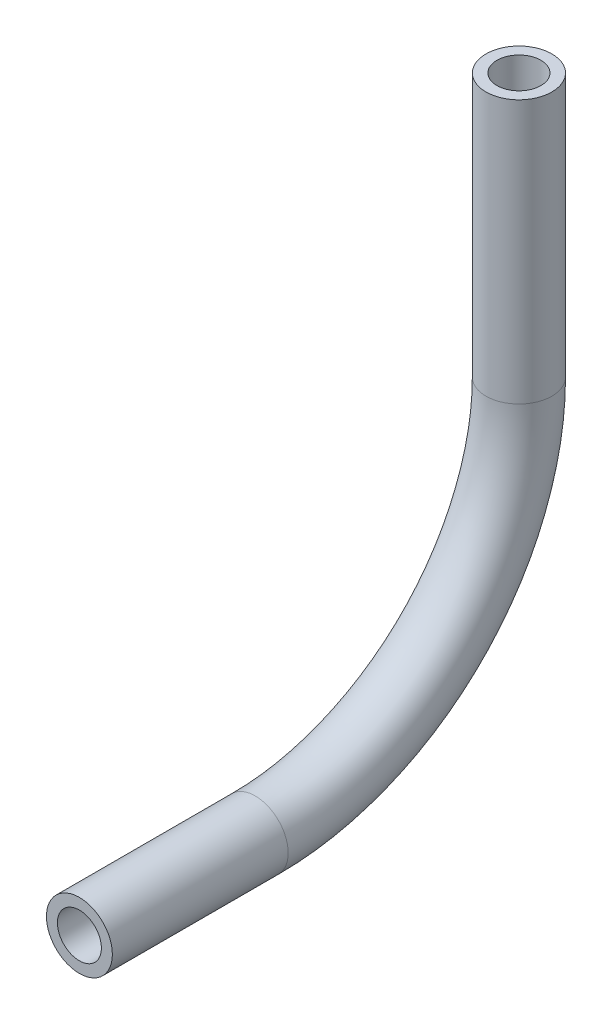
ISO-10303-21;
HEADER;
FILE_DESCRIPTION(('STEP AP214'),'2;1');
FILE_NAME('part.step','',(''),(''),'','','');
FILE_SCHEMA(('AUTOMOTIVE_DESIGN { 1 0 10303 214 1 1 1 1 }'));
ENDSEC;
DATA;
#1=APPLICATION_CONTEXT('core data for automotive mechanical design processes');
#2=APPLICATION_PROTOCOL_DEFINITION('international standard','automotive_design',2000,#1);
#3=PRODUCT_CONTEXT('',#1,'mechanical');
#4=PRODUCT('Part','Part','',(#3));
#5=PRODUCT_RELATED_PRODUCT_CATEGORY('part','',(#4));
#6=PRODUCT_DEFINITION_FORMATION('','',#4);
#7=PRODUCT_DEFINITION_CONTEXT('part definition',#1,'design');
#8=PRODUCT_DEFINITION('design','',#6,#7);
#9=PRODUCT_DEFINITION_SHAPE('','',#8);
#10=(LENGTH_UNIT() NAMED_UNIT(*) SI_UNIT(.MILLI.,.METRE.));
#11=(NAMED_UNIT(*) PLANE_ANGLE_UNIT() SI_UNIT($,.RADIAN.));
#12=(NAMED_UNIT(*) SI_UNIT($,.STERADIAN.) SOLID_ANGLE_UNIT());
#13=UNCERTAINTY_MEASURE_WITH_UNIT(LENGTH_MEASURE(1.E-05),#10,'distance_accuracy_value','');
#14=(GEOMETRIC_REPRESENTATION_CONTEXT(3) GLOBAL_UNCERTAINTY_ASSIGNED_CONTEXT((#13)) GLOBAL_UNIT_ASSIGNED_CONTEXT((#10,
#11,#12)) REPRESENTATION_CONTEXT('',''));
#15=CARTESIAN_POINT('',(0.,0.,0.));
#16=DIRECTION('',(0.,0.,1.));
#17=DIRECTION('',(1.,0.,0.));
#18=AXIS2_PLACEMENT_3D('',#15,#16,#17);
#19=CARTESIAN_POINT('',(0.,76.2,-127.));
#20=DIRECTION('',(0.,1.,0.));
#21=DIRECTION('',(0.,0.,1.));
#22=AXIS2_PLACEMENT_3D('',#19,#20,#21);
#23=CYLINDRICAL_SURFACE('',#22,9.525);
#24=CARTESIAN_POINT('',(0.,76.2,-127.));
#25=DIRECTION('',(0.,-1.,0.));
#26=DIRECTION('',(1.,0.,0.));
#27=AXIS2_PLACEMENT_3D('',#24,#25,#26);
#28=CIRCLE('',#27,9.525);
#29=CARTESIAN_POINT('',(0.,76.2,-136.525));
#30=VERTEX_POINT('',#29);
#31=EDGE_CURVE('E41',#30,#30,#28,.T.);
#32=ORIENTED_EDGE('',*,*,#31,.F.);
#33=EDGE_LOOP('',(#32));
#34=FACE_BOUND('',#33,.T.);
#35=CARTESIAN_POINT('',(0.,152.3293312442,-127.));
#36=DIRECTION('',(0.,-1.,0.));
#37=DIRECTION('',(1.,0.,0.));
#38=AXIS2_PLACEMENT_3D('',#35,#36,#37);
#39=CIRCLE('',#38,9.525);
#40=CARTESIAN_POINT('',(9.525,152.3293312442,-127.));
#41=VERTEX_POINT('',#40);
#42=EDGE_CURVE('E10',#41,#41,#39,.T.);
#43=ORIENTED_EDGE('',*,*,#42,.T.);
#44=EDGE_LOOP('',(#43));
#45=FACE_BOUND('',#44,.T.);
#46=ADVANCED_FACE('F31',(#34,#45),#23,.T.);
#47=CARTESIAN_POINT('',(0.,76.2,-127.));
#48=DIRECTION('',(0.,1.,0.));
#49=DIRECTION('',(0.,0.,1.));
#50=AXIS2_PLACEMENT_3D('',#47,#48,#49);
#51=CYLINDRICAL_SURFACE('',#50,6.35);
#52=CARTESIAN_POINT('',(0.,76.2,-127.));
#53=DIRECTION('',(0.,-1.,0.));
#54=DIRECTION('',(1.,0.,0.));
#55=AXIS2_PLACEMENT_3D('',#52,#53,#54);
#56=CIRCLE('',#55,6.35);
#57=CARTESIAN_POINT('',(0.,76.2,-133.35));
#58=VERTEX_POINT('',#57);
#59=EDGE_CURVE('E45',#58,#58,#56,.T.);
#60=ORIENTED_EDGE('',*,*,#59,.T.);
#61=EDGE_LOOP('',(#60));
#62=FACE_BOUND('',#61,.T.);
#63=CARTESIAN_POINT('',(0.,152.3293312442,-127.));
#64=DIRECTION('',(0.,-1.,0.));
#65=DIRECTION('',(1.,0.,0.));
#66=AXIS2_PLACEMENT_3D('',#63,#64,#65);
#67=CIRCLE('',#66,6.35);
#68=CARTESIAN_POINT('',(6.35,152.3293312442,-127.));
#69=VERTEX_POINT('',#68);
#70=EDGE_CURVE('E37',#69,#69,#67,.T.);
#71=ORIENTED_EDGE('',*,*,#70,.F.);
#72=EDGE_LOOP('',(#71));
#73=FACE_BOUND('',#72,.T.);
#74=ADVANCED_FACE('F88',(#62,#73),#51,.F.);
#75=CARTESIAN_POINT('',(0.,76.2,-50.8));
#76=DIRECTION('',(1.,0.,0.));
#77=DIRECTION('',(0.,0.,-1.));
#78=AXIS2_PLACEMENT_3D('',#75,#76,#77);
#79=TOROIDAL_SURFACE('',#78,76.2,9.525);
#80=CARTESIAN_POINT('',(0.,0.,-50.8));
#81=DIRECTION('',(0.,0.,1.));
#82=DIRECTION('',(1.,0.,0.));
#83=AXIS2_PLACEMENT_3D('',#80,#81,#82);
#84=CIRCLE('',#83,9.525);
#85=CARTESIAN_POINT('',(0.,-9.52499999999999,-50.8));
#86=VERTEX_POINT('',#85);
#87=EDGE_CURVE('E50',#86,#86,#84,.T.);
#88=CARTESIAN_POINT('',(0.,76.2,-50.8));
#89=DIRECTION('',(1.,0.,0.));
#90=DIRECTION('',(0.,0.,-1.));
#91=AXIS2_PLACEMENT_3D('',#88,#89,#90);
#92=CIRCLE('',#91,85.725);
#93=EDGE_CURVE('',#86,#30,#92,.T.);
#94=ORIENTED_EDGE('',*,*,#87,.F.);
#95=ORIENTED_EDGE('',*,*,#31,.T.);
#96=ORIENTED_EDGE('',*,*,#93,.T.);
#97=ORIENTED_EDGE('',*,*,#93,.F.);
#98=EDGE_LOOP('',(#94,#96,#95,#97));
#99=FACE_BOUND('',#98,.T.);
#100=ADVANCED_FACE('F93',(#99),#79,.T.);
#101=CARTESIAN_POINT('',(0.,76.2,-50.8));
#102=DIRECTION('',(1.,0.,0.));
#103=DIRECTION('',(0.,0.,-1.));
#104=AXIS2_PLACEMENT_3D('',#101,#102,#103);
#105=TOROIDAL_SURFACE('',#104,76.2,6.35);
#106=CARTESIAN_POINT('',(0.,0.,-50.8));
#107=DIRECTION('',(0.,0.,1.));
#108=DIRECTION('',(1.,0.,0.));
#109=AXIS2_PLACEMENT_3D('',#106,#107,#108);
#110=CIRCLE('',#109,6.35);
#111=CARTESIAN_POINT('',(0.,-6.34999999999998,-50.8));
#112=VERTEX_POINT('',#111);
#113=EDGE_CURVE('E54',#112,#112,#110,.T.);
#114=CARTESIAN_POINT('',(0.,76.2,-50.8));
#115=DIRECTION('',(1.,0.,0.));
#116=DIRECTION('',(0.,0.,-1.));
#117=AXIS2_PLACEMENT_3D('',#114,#115,#116);
#118=CIRCLE('',#117,82.55);
#119=EDGE_CURVE('',#112,#58,#118,.T.);
#120=ORIENTED_EDGE('',*,*,#113,.T.);
#121=ORIENTED_EDGE('',*,*,#59,.F.);
#122=ORIENTED_EDGE('',*,*,#119,.T.);
#123=ORIENTED_EDGE('',*,*,#119,.F.);
#124=EDGE_LOOP('',(#120,#122,#121,#123));
#125=FACE_BOUND('',#124,.T.);
#126=ADVANCED_FACE('F63',(#125),#105,.F.);
#127=CARTESIAN_POINT('',(0.,0.,-50.8));
#128=DIRECTION('',(0.,0.,1.));
#129=DIRECTION('',(1.,0.,0.));
#130=AXIS2_PLACEMENT_3D('',#127,#128,#129);
#131=CYLINDRICAL_SURFACE('',#130,6.35);
#132=ORIENTED_EDGE('',*,*,#113,.F.);
#133=EDGE_LOOP('',(#132));
#134=FACE_BOUND('',#133,.T.);
#135=CARTESIAN_POINT('',(0.,0.,0.));
#136=DIRECTION('',(0.,0.,1.));
#137=DIRECTION('',(1.,0.,0.));
#138=AXIS2_PLACEMENT_3D('',#135,#136,#137);
#139=CIRCLE('',#138,6.35);
#140=CARTESIAN_POINT('',(6.35,0.,0.));
#141=VERTEX_POINT('',#140);
#142=EDGE_CURVE('E55',#141,#141,#139,.T.);
#143=ORIENTED_EDGE('',*,*,#142,.T.);
#144=EDGE_LOOP('',(#143));
#145=FACE_BOUND('',#144,.T.);
#146=ADVANCED_FACE('F66',(#134,#145),#131,.F.);
#147=CARTESIAN_POINT('',(0.,0.,-50.8));
#148=DIRECTION('',(0.,0.,1.));
#149=DIRECTION('',(1.,0.,0.));
#150=AXIS2_PLACEMENT_3D('',#147,#148,#149);
#151=CYLINDRICAL_SURFACE('',#150,9.525);
#152=ORIENTED_EDGE('',*,*,#87,.T.);
#153=EDGE_LOOP('',(#152));
#154=FACE_BOUND('',#153,.T.);
#155=CARTESIAN_POINT('',(0.,0.,0.));
#156=DIRECTION('',(0.,0.,1.));
#157=DIRECTION('',(1.,0.,0.));
#158=AXIS2_PLACEMENT_3D('',#155,#156,#157);
#159=CIRCLE('',#158,9.525);
#160=CARTESIAN_POINT('',(9.525,0.,0.));
#161=VERTEX_POINT('',#160);
#162=EDGE_CURVE('E51',#161,#161,#159,.T.);
#163=ORIENTED_EDGE('',*,*,#162,.F.);
#164=EDGE_LOOP('',(#163));
#165=FACE_BOUND('',#164,.T.);
#166=ADVANCED_FACE('F69',(#154,#165),#151,.T.);
#167=CARTESIAN_POINT('',(0.,152.3293312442,-127.));
#168=DIRECTION('',(0.,-1.,0.));
#169=DIRECTION('',(1.,0.,0.));
#170=AXIS2_PLACEMENT_3D('',#167,#168,#169);
#171=PLANE('',#170);
#172=ORIENTED_EDGE('',*,*,#70,.T.);
#173=EDGE_LOOP('',(#172));
#174=FACE_BOUND('',#173,.T.);
#175=ORIENTED_EDGE('',*,*,#42,.F.);
#176=EDGE_LOOP('',(#175));
#177=FACE_BOUND('',#176,.T.);
#178=ADVANCED_FACE('F76',(#174,#177),#171,.F.);
#179=CARTESIAN_POINT('',(0.,0.,0.));
#180=DIRECTION('',(0.,0.,1.));
#181=DIRECTION('',(1.,0.,0.));
#182=AXIS2_PLACEMENT_3D('',#179,#180,#181);
#183=PLANE('',#182);
#184=ORIENTED_EDGE('',*,*,#142,.F.);
#185=EDGE_LOOP('',(#184));
#186=FACE_BOUND('',#185,.T.);
#187=ORIENTED_EDGE('',*,*,#162,.T.);
#188=EDGE_LOOP('',(#187));
#189=FACE_BOUND('',#188,.T.);
#190=ADVANCED_FACE('F73',(#186,#189),#183,.T.);
#191=CLOSED_SHELL('',(#46,#74,#100,#126,#146,#166,#178,#190));
#192=MANIFOLD_SOLID_BREP('B2',#191);
#193=ADVANCED_BREP_SHAPE_REPRESENTATION('',(#18,#192),#14);
#194=SHAPE_DEFINITION_REPRESENTATION(#9,#193);
ENDSEC;
END-ISO-10303-21;
